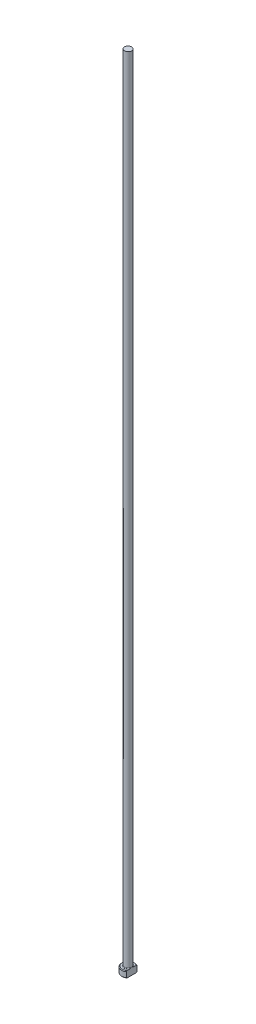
from build123d import *
from build123d.topology import SkipClean

# Parameters (mm, degrees)
CHAMFER1_SIZE = 0.2
FILLET1_R     = 0.2
KEY_DEPTH     = 251.015999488


with BuildPart() as part:
    # Sketch1 → Revolve1 (revolve)
    with BuildSketch(Plane.XY, mode=Mode.PRIVATE) as revolve1_sk:
        Polygon((0, 0), (-2, 0), (-2, 2), (-1.1, 2), (-1.1, 250), (0, 250), align=None)
    revolve(revolve1_sk.sketch.rotate(Axis((0, 259.958771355, 0), (0, -1, 0)), 270), axis=Axis((0, 259.958771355, 0), (0, -1, 0)))

    # Chamfer1
    chamfer1_edges = [part.edges().sort_by_distance(p)[0] for p in [
        (0, 2, -2),
        (0, 0, -2),
    ]]
    chamfer(chamfer1_edges, length=CHAMFER1_SIZE)

    # Fillet1
    fillet1_edges = [part.edges().sort_by_distance(p)[0] for p in [
        (0, 2, -1.1),
    ]]
    fillet(fillet1_edges, radius=FILLET1_R)

    # Sketch2 → KEY (cut, through all)
    with SkipClean():  # the faces are left unmerged after this step: merging them gives an invalid solid
        with BuildSketch(Plane(origin=(0, 0, 0), x_dir=(1, 0, 0), z_dir=(0, 1, 0))):
            with BuildLine():
                Line((1.1, 1.670329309), (1.1, -1.670329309))
                ThreePointArc((1.1, -1.670329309), (2, 0), (1.1, 1.670329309))
            make_face()
        extrude(amount=KEY_DEPTH, mode=Mode.SUBTRACT)


solid = part.part
